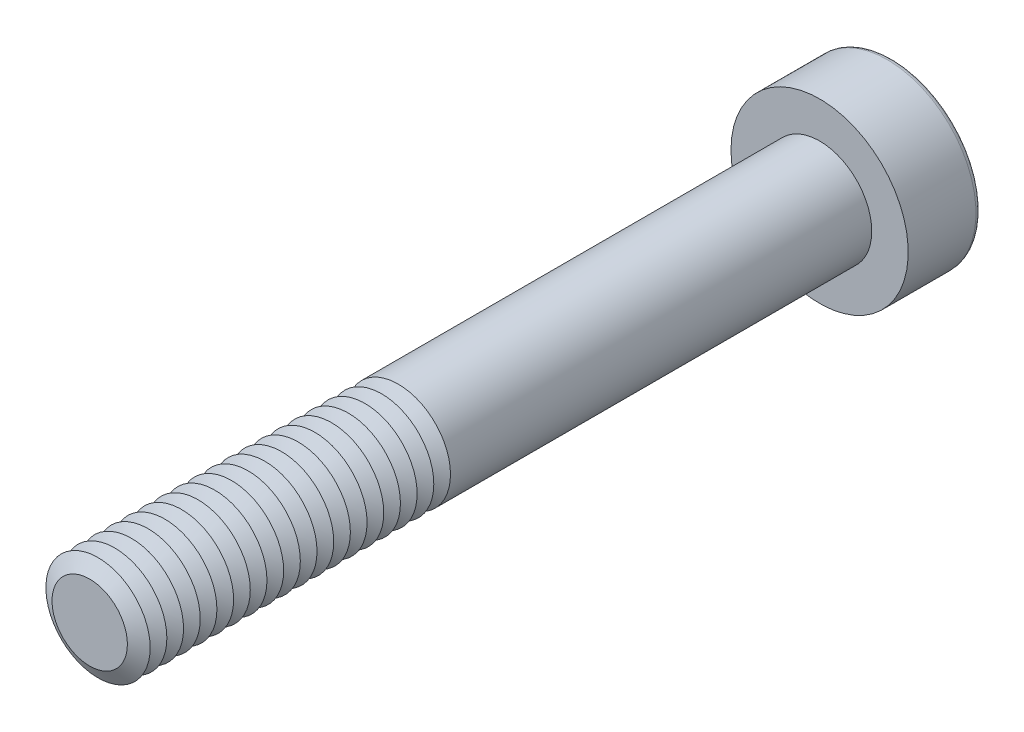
from build123d import *

# Parameters (mm, degrees)
SKETCH1_R           = 2.5
BOSS_EXTRUDE1_DEPTH = 35
SKETCH2_R           = 4.25
BOSS_EXTRUDE2_DEPTH = 3.5
CUT_EXTRUDE1_DEPTH  = 2.25
FILLET1_R           = 0.25
LPATTERN1_COUNT     = 19
LPATTERN1_PITCH     = 0.8


with BuildPart() as part:
    # Sketch1 → Boss-Extrude1 (new body)
    with BuildSketch(Plane.XY):
        Circle(SKETCH1_R)
    extrude(amount=BOSS_EXTRUDE1_DEPTH)

    # Sketch2 → Boss-Extrude2 (add)
    with BuildSketch(Plane(origin=(0, 0, 0), x_dir=(-1, 0, 0), z_dir=(0, 0, -1))):
        Circle(SKETCH2_R)
    extrude(amount=BOSS_EXTRUDE2_DEPTH)

    # Sketch3 → Cut-Extrude1 (cut)
    with BuildSketch(Plane(origin=(0, 0, -3.5), x_dir=(-1, 0, 0), z_dir=(0, 0, -1))):
        Polygon((-0.866025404, 1.5), (-1.732050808, 0), (-0.866025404, -1.5), (0.866025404, -1.5), (1.732050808, 0), (0.866025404, 1.5), align=None)
    extrude(amount=-CUT_EXTRUDE1_DEPTH, mode=Mode.SUBTRACT)

    # Fillet1
    fillet1_edges = [part.edges().sort_by_distance(p)[0] for p in [
        (4.25, 0, -3.5),
    ]]
    fillet(fillet1_edges, radius=FILLET1_R)

    # Cut-Extrude2 cone 1 section (on through the dimple's axis) → Cut-Extrude2 (revolve, cut)
    with BuildSketch(Plane(origin=(0, 0, -1.25), x_dir=(0, 1, 0), z_dir=(1, 0, 0))):
        Polygon((0, 0), (1.5, 0), (0, 0.866025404), align=None)
    revolve(axis=Axis((0, 0, -1.25), (0, 0, 1)), mode=Mode.SUBTRACT)

    # Cut-Extrude3 cone 1 section (on through the dimple's axis) → Cut-Extrude3 (revolve, cut)
    with BuildSketch(Plane(origin=(0, 0, -3.5), x_dir=(0, 1, 0), z_dir=(1, 0, 0))):
        Polygon((0, 0), (1.732050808, 0), (0, 0.464101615), align=None)
    revolve(axis=Axis((0, 0, -3.5), (0, 0, 1)), mode=Mode.SUBTRACT)

    # Sketch7 → Cut-Revolve1 (revolve, cut)
    with BuildSketch(Plane(origin=(0, 0, 0), x_dir=(0, 0, -1), z_dir=(1, 0, 0)), mode=Mode.PRIVATE) as cut_revolve1_sk:
        Polygon((-35, 1.807179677), (-34.6, 2.5), (-35.4, 2.5), align=None)
    cut_revolve1 = revolve(cut_revolve1_sk.sketch.rotate(Axis((0, 0, 35), (0, 0, -1)), 90), axis=Axis((0, 0, 35), (0, 0, -1)), mode=Mode.SUBTRACT)

    # LPattern1: Cut-Revolve1 ×19
    with Locations(*[(0, 0, -i * LPATTERN1_PITCH) for i in range(1, LPATTERN1_COUNT)]):
        add(cut_revolve1, mode=Mode.SUBTRACT)


solid = part.part
